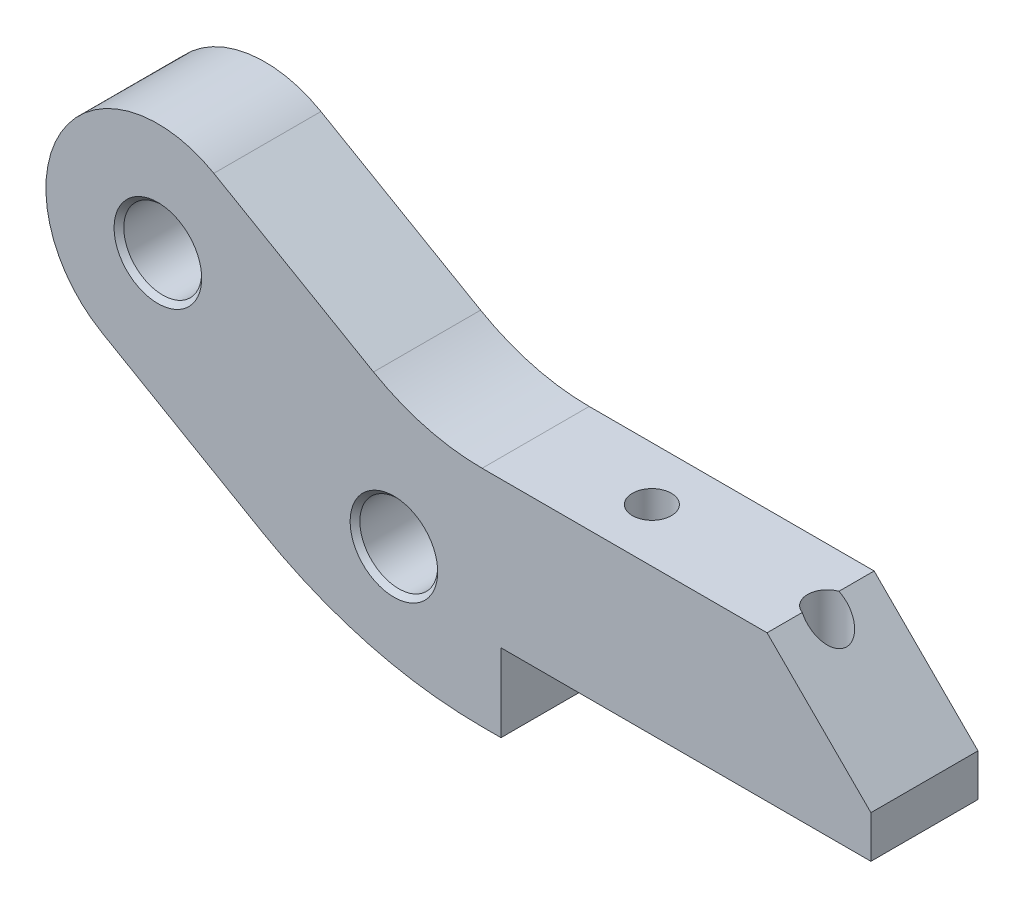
from build123d import *

# Parameters (mm, degrees)
BASE_EXTRUSION_DEPTH    = 11
ESQUISSE2_R             = 4
ENL_V_MAT_EXTRU_1_DEPTH = 79.487260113
CHANFREIN1_SIZE         = 0.5
ESQUISSE3_R             = 4
ENL_V_MAT_EXTRU_3_DEPTH = 76.099025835
CHANFREIN2_SIZE         = 0.5
ESQUISSE4_R             = 2
ENL_V_MAT_EXTRU_4_DEPTH = 21.849235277


with BuildPart() as part:
    # Esquisse1 → Base-Extrusion (new body)
    with BuildSketch(Plane.XY):
        with BuildLine():
            Line((23.059250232, 31.5), (52.331191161, 31.5))
            Line((52.331191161, 31.5), (63, 20.831191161))
            Line((63, 20.831191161), (63, 16.5))
            Line((63, 16.5), (25, 16.5))
            Line((25, 16.5), (25, 8.5))
            Line((25, 8.5), (23.059250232, 8.5))
            ThreePointArc((23.059250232, 8.5), (11.332267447, 10.043886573), (0.40445916, 14.570332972))
            Line((0.40445916, 14.570332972), (-15.998711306, 24.040707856))
            ThreePointArc((-15.998711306, 24.040707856), (-20.208003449, 39.75), (-4.498711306, 43.959292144))
            Line((-4.498711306, 43.959292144), (11.90445916, 34.488917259))
            ThreePointArc((11.90445916, 34.488917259), (17.285105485, 32.260180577), (23.059250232, 31.5))
        make_face()
    extrude(amount=BASE_EXTRUSION_DEPTH)

    # Esquisse2 → Enl_v. mat.-Extru.1 (cut, through all)
    with BuildSketch(Plane.XY.offset(11)):
        with Locations((-10.248711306, 34)):
            Circle(ESQUISSE2_R)
    extrude(amount=-ENL_V_MAT_EXTRU_1_DEPTH, mode=Mode.SUBTRACT)

    # Chanfrein1
    chanfrein1_edges = [part.edges().sort_by_distance(p)[0] for p in [
        (-14.248711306, 34, 0),
        (-14.248711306, 34, 11),
    ]]
    chamfer(chanfrein1_edges, length=CHANFREIN1_SIZE)

    # Esquisse3 → Enl_v. mat.-Extru.3 (cut, through all)
    with BuildSketch(Plane(origin=(23.483322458, -13.431543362, 11), x_dir=(1, 0, 0), z_dir=(0, 0, 1))):
        with Locations((-9.483322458, 33.431543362)):
            Circle(ESQUISSE3_R)
    extrude(amount=-ENL_V_MAT_EXTRU_3_DEPTH, mode=Mode.SUBTRACT)

    # Chanfrein2
    chanfrein2_edges = [part.edges().sort_by_distance(p)[0] for p in [
        (10, 20, 0),
        (10, 20, 11),
    ]]
    chamfer(chanfrein2_edges, length=CHANFREIN2_SIZE)

    # Esquisse4 → Enl_v. mat.-Extru.4 (cut)
    with BuildSketch(Plane.XZ.offset(-16.5)):
        with Locations(Location((35, 5.5, 0), (0, 0, 270))):
            Circle(ESQUISSE4_R)
        with Locations(Location((53, 5.5, 0), (0, 0, 270))):
            Circle(ESQUISSE4_R)
    extrude(amount=-ENL_V_MAT_EXTRU_4_DEPTH, mode=Mode.SUBTRACT)


solid = part.part
